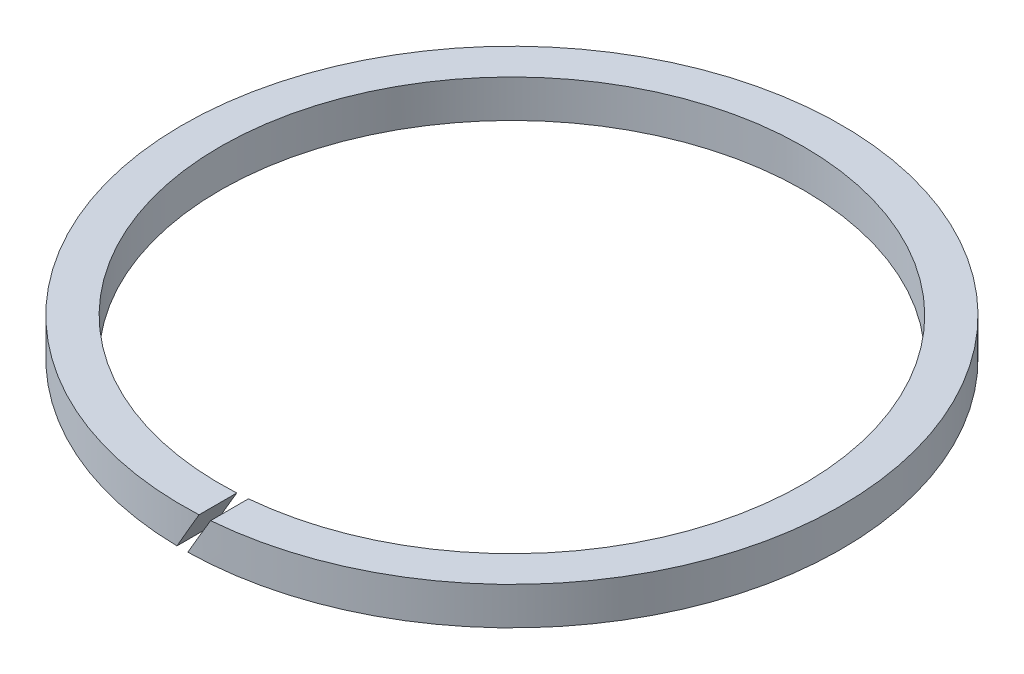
from build123d import *

# Parameters (mm, degrees)
ESQUISSE1_W             = 2
ESQUISSE1_H             = 2
ENL_V_MAT_EXTRU_1_DEPTH = 25.829418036


with BuildPart() as part:
    # Esquisse1 → Base-R_volution (revolve)
    with BuildSketch(Plane.XY):
        with Locations((16.5, 1)):
            Rectangle(ESQUISSE1_W, ESQUISSE1_H)
    revolve(axis=Axis((0, 50.033968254, 0), (0, -1, 0)))

    # Esquisse2 → Enl_v. mat.-Extru.1 (cut, through all)
    with BuildSketch(Plane.XY):
        Polygon((1.944340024, 2.867695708), (-0.327242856, -1.066801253), (-0.904593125, -1.066801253), (1.366989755, 2.867695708), align=None)
    extrude(amount=ENL_V_MAT_EXTRU_1_DEPTH, mode=Mode.SUBTRACT)


solid = part.part
